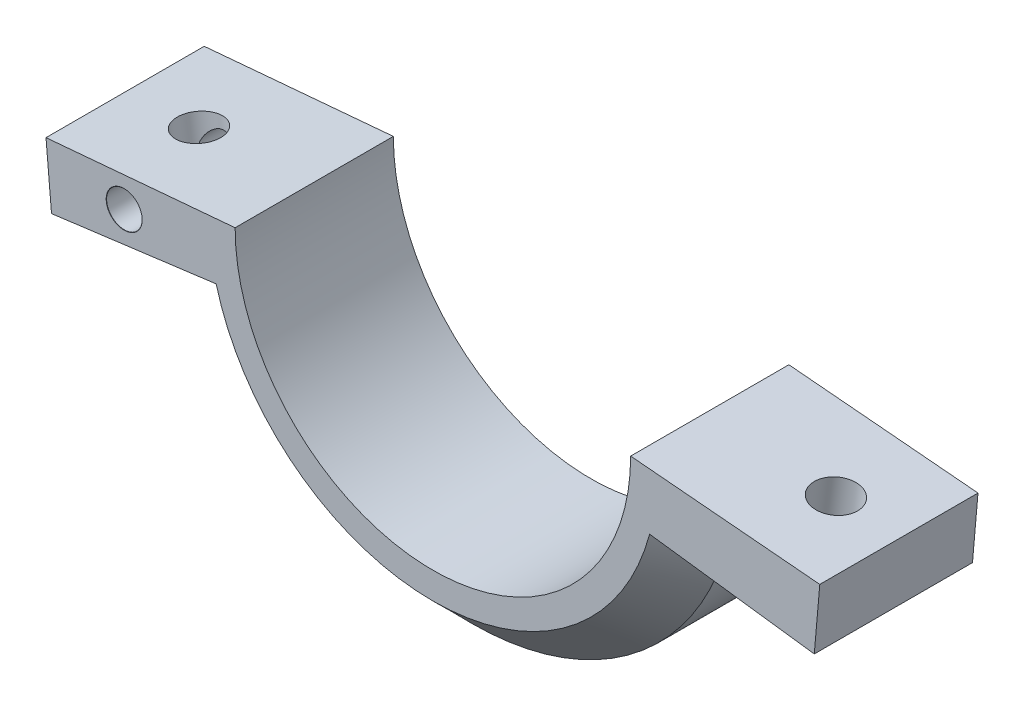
ISO-10303-21;
HEADER;
FILE_DESCRIPTION(('STEP AP214'),'2;1');
FILE_NAME('part.step','',(''),(''),'','','');
FILE_SCHEMA(('AUTOMOTIVE_DESIGN { 1 0 10303 214 1 1 1 1 }'));
ENDSEC;
DATA;
#1=APPLICATION_CONTEXT('core data for automotive mechanical design processes');
#2=APPLICATION_PROTOCOL_DEFINITION('international standard','automotive_design',2000,#1);
#3=PRODUCT_CONTEXT('',#1,'mechanical');
#4=PRODUCT('Part','Part','',(#3));
#5=PRODUCT_RELATED_PRODUCT_CATEGORY('part','',(#4));
#6=PRODUCT_DEFINITION_FORMATION('','',#4);
#7=PRODUCT_DEFINITION_CONTEXT('part definition',#1,'design');
#8=PRODUCT_DEFINITION('design','',#6,#7);
#9=PRODUCT_DEFINITION_SHAPE('','',#8);
#10=(LENGTH_UNIT() NAMED_UNIT(*) SI_UNIT(.MILLI.,.METRE.));
#11=(NAMED_UNIT(*) PLANE_ANGLE_UNIT() SI_UNIT($,.RADIAN.));
#12=(NAMED_UNIT(*) SI_UNIT($,.STERADIAN.) SOLID_ANGLE_UNIT());
#13=UNCERTAINTY_MEASURE_WITH_UNIT(LENGTH_MEASURE(1.E-05),#10,'distance_accuracy_value','');
#14=(GEOMETRIC_REPRESENTATION_CONTEXT(3) GLOBAL_UNCERTAINTY_ASSIGNED_CONTEXT((#13)) GLOBAL_UNIT_ASSIGNED_CONTEXT((#10,
#11,#12)) REPRESENTATION_CONTEXT('',''));
#15=CARTESIAN_POINT('',(0.,0.,0.));
#16=DIRECTION('',(0.,0.,1.));
#17=DIRECTION('',(1.,0.,0.));
#18=AXIS2_PLACEMENT_3D('',#15,#16,#17);
#19=CARTESIAN_POINT('',(-32.3934655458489,51.2410673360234,-20.));
#20=DIRECTION('',(-0.129221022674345,0.991615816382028,0.));
#21=DIRECTION('',(-0.991615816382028,-0.129221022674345,0.));
#22=AXIS2_PLACEMENT_3D('',#19,#20,#21);
#23=PLANE('',#22);
#24=DIRECTION('',(-0.991615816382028,-0.129221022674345,0.));
#25=VECTOR('',#24,1.);
#26=CARTESIAN_POINT('',(-32.3934655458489,51.2410673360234,0.));
#27=LINE('',#26,#25);
#28=CARTESIAN_POINT('',(-27.3981953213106,51.8920189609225,0.));
#29=VERTEX_POINT('',#28);
#30=CARTESIAN_POINT('',(-48.2114268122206,49.1797719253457,0.));
#31=VERTEX_POINT('',#30);
#32=EDGE_CURVE('E154',#29,#31,#27,.T.);
#33=ORIENTED_EDGE('',*,*,#32,.T.);
#34=DIRECTION('',(0.,0.,1.));
#35=VECTOR('',#34,1.);
#36=CARTESIAN_POINT('',(-48.2114268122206,49.1797719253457,-20.));
#37=LINE('',#36,#35);
#38=CARTESIAN_POINT('',(-48.2114268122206,49.1797719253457,-20.));
#39=VERTEX_POINT('',#38);
#40=EDGE_CURVE('E137',#39,#31,#37,.T.);
#41=ORIENTED_EDGE('',*,*,#40,.F.);
#42=DIRECTION('',(-0.991615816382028,-0.129221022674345,0.));
#43=VECTOR('',#42,1.);
#44=CARTESIAN_POINT('',(-32.3934655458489,51.2410673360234,-20.));
#45=LINE('',#44,#43);
#46=CARTESIAN_POINT('',(-27.3981953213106,51.8920189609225,-20.));
#47=VERTEX_POINT('',#46);
#48=EDGE_CURVE('E79',#47,#39,#45,.T.);
#49=ORIENTED_EDGE('',*,*,#48,.F.);
#50=CARTESIAN_POINT('',(-27.3981953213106,51.8920189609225,-20.));
#51=CARTESIAN_POINT('',(-27.8147416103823,51.8377373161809,-19.5836115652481));
#52=CARTESIAN_POINT('',(-28.2312082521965,51.7834660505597,-19.1671421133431));
#53=CARTESIAN_POINT('',(-29.0639994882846,51.6749420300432,-18.3340588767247));
#54=CARTESIAN_POINT('',(-29.4803240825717,51.6206892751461,-17.9174450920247));
#55=CARTESIAN_POINT('',(-30.3128485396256,51.5122000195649,-17.0840908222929));
#56=CARTESIAN_POINT('',(-30.7290484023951,51.4579635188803,-16.6673503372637));
#57=CARTESIAN_POINT('',(-31.5613369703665,51.3495050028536,-15.8337564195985));
#58=CARTESIAN_POINT('',(-31.977425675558,51.2952829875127,-15.4169029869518));
#59=CARTESIAN_POINT('',(-32.3934655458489,51.2410673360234,-15.));
#60=B_SPLINE_CURVE_WITH_KNOTS('',3,(#50,#51,#52,#53,#54,#55,#56,#57,#58,#59),.UNSPECIFIED.,.F.,
.F.,(4,2,2,2,4),(0.,1.77440965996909,3.54881915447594,5.32322861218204,7.09763823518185),.UNSPECIFIED.);
#61=CARTESIAN_POINT('',(-32.3934655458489,51.2410673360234,-15.));
#62=VERTEX_POINT('',#61);
#63=EDGE_CURVE('E11',#47,#62,#60,.T.);
#64=ORIENTED_EDGE('',*,*,#63,.T.);
#65=DIRECTION('',(0.,0.,1.));
#66=VECTOR('',#65,1.);
#67=CARTESIAN_POINT('',(-32.3934655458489,51.2410673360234,-20.));
#68=LINE('',#67,#66);
#69=CARTESIAN_POINT('',(-32.3934655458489,51.2410673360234,-5.00000000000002));
#70=VERTEX_POINT('',#69);
#71=EDGE_CURVE('E266',#62,#70,#68,.T.);
#72=ORIENTED_EDGE('',*,*,#71,.T.);
#73=CARTESIAN_POINT('',(-32.3934655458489,51.2410673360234,-5.00000000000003));
#74=CARTESIAN_POINT('',(-31.977425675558,51.2952829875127,-4.58309701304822));
#75=CARTESIAN_POINT('',(-31.5613369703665,51.3495050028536,-4.16624358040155));
#76=CARTESIAN_POINT('',(-30.7290484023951,51.4579635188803,-3.33264966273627));
#77=CARTESIAN_POINT('',(-30.3128485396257,51.5122000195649,-2.91590917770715));
#78=CARTESIAN_POINT('',(-29.4803240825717,51.6206892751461,-2.08255490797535));
#79=CARTESIAN_POINT('',(-29.0639994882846,51.6749420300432,-1.6659411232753));
#80=CARTESIAN_POINT('',(-28.2312082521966,51.7834660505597,-0.83285788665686));
#81=CARTESIAN_POINT('',(-27.8147416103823,51.8377373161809,-0.416388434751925));
#82=CARTESIAN_POINT('',(-27.3981953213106,51.8920189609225,0.));
#83=B_SPLINE_CURVE_WITH_KNOTS('',3,(#73,#74,#75,#76,#77,#78,#79,#80,#81,#82),.UNSPECIFIED.,.F.,
.F.,(4,2,2,2,4),(0.,1.77440962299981,3.54881908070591,5.32322857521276,7.09763823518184),.UNSPECIFIED.);
#84=EDGE_CURVE('E183',#70,#29,#83,.T.);
#85=ORIENTED_EDGE('',*,*,#84,.T.);
#86=EDGE_LOOP('',(#33,#41,#49,#64,#72,#85));
#87=FACE_BOUND('',#86,.T.);
#88=CARTESIAN_POINT('',(-38.5657501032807,50.4367347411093,-9.979379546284));
#89=DIRECTION('',(0.129221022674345,-0.991615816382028,0.));
#90=DIRECTION('',(0.991615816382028,0.129221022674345,0.));
#91=AXIS2_PLACEMENT_3D('',#88,#89,#90);
#92=CIRCLE('',#91,2.775);
#93=CARTESIAN_POINT('',(-35.8140162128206,50.7953230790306,-9.979379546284));
#94=VERTEX_POINT('',#93);
#95=EDGE_CURVE('E318',#94,#94,#92,.T.);
#96=ORIENTED_EDGE('',*,*,#95,.F.);
#97=EDGE_LOOP('',(#96));
#98=FACE_BOUND('',#97,.T.);
#99=ADVANCED_FACE('F47',(#87,#98),#23,.F.);
#100=CARTESIAN_POINT('',(-48.2114268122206,49.1797719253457,-20.));
#101=DIRECTION('',(0.996194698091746,0.0871557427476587,0.));
#102=DIRECTION('',(-0.0871557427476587,0.996194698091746,0.));
#103=AXIS2_PLACEMENT_3D('',#100,#101,#102);
#104=PLANE('',#103);
#105=DIRECTION('',(-0.0871557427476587,0.996194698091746,0.));
#106=VECTOR('',#105,1.);
#107=CARTESIAN_POINT('',(-48.2114268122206,49.1797719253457,0.));
#108=LINE('',#107,#106);
#109=CARTESIAN_POINT('',(-48.9086727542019,57.1493295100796,0.));
#110=VERTEX_POINT('',#109);
#111=EDGE_CURVE('E290',#31,#110,#108,.T.);
#112=ORIENTED_EDGE('',*,*,#111,.T.);
#113=DIRECTION('',(0.,0.,1.));
#114=VECTOR('',#113,1.);
#115=CARTESIAN_POINT('',(-48.9086727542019,57.1493295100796,-20.));
#116=LINE('',#115,#114);
#117=CARTESIAN_POINT('',(-48.9086727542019,57.1493295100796,-20.));
#118=VERTEX_POINT('',#117);
#119=EDGE_CURVE('E140',#118,#110,#116,.T.);
#120=ORIENTED_EDGE('',*,*,#119,.F.);
#121=DIRECTION('',(-0.0871557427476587,0.996194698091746,0.));
#122=VECTOR('',#121,1.);
#123=CARTESIAN_POINT('',(-48.2114268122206,49.1797719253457,-20.));
#124=LINE('',#123,#122);
#125=EDGE_CURVE('E135',#39,#118,#124,.T.);
#126=ORIENTED_EDGE('',*,*,#125,.F.);
#127=ORIENTED_EDGE('',*,*,#40,.T.);
#128=EDGE_LOOP('',(#112,#120,#126,#127));
#129=FACE_BOUND('',#128,.T.);
#130=ADVANCED_FACE('F136',(#129),#104,.F.);
#131=CARTESIAN_POINT('',(-48.9086727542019,57.1493295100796,-20.));
#132=DIRECTION('',(0.0871557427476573,-0.996194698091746,0.));
#133=DIRECTION('',(0.996194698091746,0.0871557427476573,0.));
#134=AXIS2_PLACEMENT_3D('',#131,#132,#133);
#135=PLANE('',#134);
#136=CARTESIAN_POINT('',(-39.5472220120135,57.9683503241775,-9.979379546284));
#137=DIRECTION('',(0.0871557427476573,-0.996194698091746,0.));
#138=DIRECTION('',(0.996194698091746,0.0871557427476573,0.));
#139=AXIS2_PLACEMENT_3D('',#136,#137,#138);
#140=ELLIPSE('',#139,2.75246408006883,2.75);
#141=CARTESIAN_POINT('',(-36.805231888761,58.2082433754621,-9.979379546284));
#142=VERTEX_POINT('',#141);
#143=EDGE_CURVE('E297',#142,#142,#140,.T.);
#144=ORIENTED_EDGE('',*,*,#143,.T.);
#145=EDGE_LOOP('',(#144));
#146=FACE_BOUND('',#145,.T.);
#147=DIRECTION('',(0.996194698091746,0.0871557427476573,0.));
#148=VECTOR('',#147,1.);
#149=CARTESIAN_POINT('',(-48.9086727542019,57.1493295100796,0.));
#150=LINE('',#149,#148);
#151=CARTESIAN_POINT('',(-25.,59.2410673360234,0.));
#152=VERTEX_POINT('',#151);
#153=EDGE_CURVE('E287',#110,#152,#150,.T.);
#154=ORIENTED_EDGE('',*,*,#153,.T.);
#155=DIRECTION('',(0.,0.,1.));
#156=VECTOR('',#155,1.);
#157=CARTESIAN_POINT('',(-25.,59.2410673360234,-20.));
#158=LINE('',#157,#156);
#159=CARTESIAN_POINT('',(-25.,59.2410673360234,-20.));
#160=VERTEX_POINT('',#159);
#161=EDGE_CURVE('E163',#160,#152,#158,.T.);
#162=ORIENTED_EDGE('',*,*,#161,.F.);
#163=DIRECTION('',(0.996194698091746,0.0871557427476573,0.));
#164=VECTOR('',#163,1.);
#165=CARTESIAN_POINT('',(-48.9086727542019,57.1493295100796,-20.));
#166=LINE('',#165,#164);
#167=EDGE_CURVE('E143',#118,#160,#166,.T.);
#168=ORIENTED_EDGE('',*,*,#167,.F.);
#169=ORIENTED_EDGE('',*,*,#119,.T.);
#170=EDGE_LOOP('',(#154,#162,#168,#169));
#171=FACE_BOUND('',#170,.T.);
#172=ADVANCED_FACE('F223',(#146,#171),#135,.F.);
#173=CARTESIAN_POINT('',(0.,59.2410673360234,-20.));
#174=DIRECTION('',(0.,0.,1.));
#175=DIRECTION('',(1.,0.,0.));
#176=AXIS2_PLACEMENT_3D('',#173,#174,#175);
#177=CYLINDRICAL_SURFACE('',#176,25.);
#178=CARTESIAN_POINT('',(0.,59.2410673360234,0.));
#179=DIRECTION('',(0.,0.,1.));
#180=DIRECTION('',(1.,0.,0.));
#181=AXIS2_PLACEMENT_3D('',#178,#179,#180);
#182=CIRCLE('',#181,25.);
#183=CARTESIAN_POINT('',(25.,59.2410673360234,0.));
#184=VERTEX_POINT('',#183);
#185=EDGE_CURVE('E255',#152,#184,#182,.T.);
#186=ORIENTED_EDGE('',*,*,#185,.T.);
#187=DIRECTION('',(0.,0.,1.));
#188=VECTOR('',#187,1.);
#189=CARTESIAN_POINT('',(25.,59.2410673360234,-20.));
#190=LINE('',#189,#188);
#191=CARTESIAN_POINT('',(25.,59.2410673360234,-20.));
#192=VERTEX_POINT('',#191);
#193=EDGE_CURVE('E249',#192,#184,#190,.T.);
#194=ORIENTED_EDGE('',*,*,#193,.F.);
#195=CARTESIAN_POINT('',(0.,59.2410673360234,-20.));
#196=DIRECTION('',(0.,0.,1.));
#197=DIRECTION('',(1.,0.,0.));
#198=AXIS2_PLACEMENT_3D('',#195,#196,#197);
#199=CIRCLE('',#198,25.);
#200=EDGE_CURVE('E284',#160,#192,#199,.T.);
#201=ORIENTED_EDGE('',*,*,#200,.F.);
#202=ORIENTED_EDGE('',*,*,#161,.T.);
#203=EDGE_LOOP('',(#186,#194,#201,#202));
#204=FACE_BOUND('',#203,.T.);
#205=ADVANCED_FACE('F226',(#204),#177,.F.);
#206=CARTESIAN_POINT('',(48.9086727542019,57.1493295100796,-20.));
#207=DIRECTION('',(0.0871557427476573,0.996194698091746,0.));
#208=DIRECTION('',(-0.996194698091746,0.0871557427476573,0.));
#209=AXIS2_PLACEMENT_3D('',#206,#207,#208);
#210=PLANE('',#209);
#211=CARTESIAN_POINT('',(40.966269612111,57.8441997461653,-9.98303676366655));
#212=DIRECTION('',(0.0871557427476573,0.996194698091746,0.));
#213=DIRECTION('',(-0.996194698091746,0.0871557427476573,0.));
#214=AXIS2_PLACEMENT_3D('',#211,#212,#213);
#215=ELLIPSE('',#214,2.75246408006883,2.75);
#216=CARTESIAN_POINT('',(38.2242794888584,58.0840927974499,-9.98303676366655));
#217=VERTEX_POINT('',#216);
#218=EDGE_CURVE('E240',#217,#217,#215,.T.);
#219=ORIENTED_EDGE('',*,*,#218,.F.);
#220=EDGE_LOOP('',(#219));
#221=FACE_BOUND('',#220,.T.);
#222=DIRECTION('',(-0.996194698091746,0.0871557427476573,0.));
#223=VECTOR('',#222,1.);
#224=CARTESIAN_POINT('',(48.9086727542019,57.1493295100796,0.));
#225=LINE('',#224,#223);
#226=CARTESIAN_POINT('',(48.9086727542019,57.1493295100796,0.));
#227=VERTEX_POINT('',#226);
#228=EDGE_CURVE('E243',#227,#184,#225,.T.);
#229=ORIENTED_EDGE('',*,*,#228,.F.);
#230=DIRECTION('',(0.,0.,1.));
#231=VECTOR('',#230,1.);
#232=CARTESIAN_POINT('',(48.9086727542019,57.1493295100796,-20.));
#233=LINE('',#232,#231);
#234=CARTESIAN_POINT('',(48.9086727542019,57.1493295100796,-20.));
#235=VERTEX_POINT('',#234);
#236=EDGE_CURVE('E246',#235,#227,#233,.T.);
#237=ORIENTED_EDGE('',*,*,#236,.F.);
#238=DIRECTION('',(-0.996194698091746,0.0871557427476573,0.));
#239=VECTOR('',#238,1.);
#240=CARTESIAN_POINT('',(48.9086727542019,57.1493295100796,-20.));
#241=LINE('',#240,#239);
#242=EDGE_CURVE('E304',#235,#192,#241,.T.);
#243=ORIENTED_EDGE('',*,*,#242,.T.);
#244=ORIENTED_EDGE('',*,*,#193,.T.);
#245=EDGE_LOOP('',(#229,#237,#243,#244));
#246=FACE_BOUND('',#245,.T.);
#247=ADVANCED_FACE('F229',(#221,#246),#210,.T.);
#248=CARTESIAN_POINT('',(48.2114268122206,49.1797719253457,-20.));
#249=DIRECTION('',(0.996194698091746,-0.0871557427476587,0.));
#250=DIRECTION('',(0.0871557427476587,0.996194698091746,0.));
#251=AXIS2_PLACEMENT_3D('',#248,#249,#250);
#252=PLANE('',#251);
#253=DIRECTION('',(0.0871557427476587,0.996194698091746,0.));
#254=VECTOR('',#253,1.);
#255=CARTESIAN_POINT('',(48.2114268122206,49.1797719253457,0.));
#256=LINE('',#255,#254);
#257=CARTESIAN_POINT('',(48.2114268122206,49.1797719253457,0.));
#258=VERTEX_POINT('',#257);
#259=EDGE_CURVE('E254',#258,#227,#256,.T.);
#260=ORIENTED_EDGE('',*,*,#259,.F.);
#261=DIRECTION('',(0.,0.,1.));
#262=VECTOR('',#261,1.);
#263=CARTESIAN_POINT('',(48.2114268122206,49.1797719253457,-20.));
#264=LINE('',#263,#262);
#265=CARTESIAN_POINT('',(48.2114268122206,49.1797719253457,-20.));
#266=VERTEX_POINT('',#265);
#267=EDGE_CURVE('E274',#266,#258,#264,.T.);
#268=ORIENTED_EDGE('',*,*,#267,.F.);
#269=DIRECTION('',(0.0871557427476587,0.996194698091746,0.));
#270=VECTOR('',#269,1.);
#271=CARTESIAN_POINT('',(48.2114268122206,49.1797719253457,-20.));
#272=LINE('',#271,#270);
#273=EDGE_CURVE('E300',#266,#235,#272,.T.);
#274=ORIENTED_EDGE('',*,*,#273,.T.);
#275=ORIENTED_EDGE('',*,*,#236,.T.);
#276=EDGE_LOOP('',(#260,#268,#274,#275));
#277=FACE_BOUND('',#276,.T.);
#278=ADVANCED_FACE('F199',(#277),#252,.T.);
#279=CARTESIAN_POINT('',(32.3934655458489,51.2410673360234,-20.));
#280=DIRECTION('',(-0.129221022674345,-0.991615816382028,0.));
#281=DIRECTION('',(0.991615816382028,-0.129221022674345,0.));
#282=AXIS2_PLACEMENT_3D('',#279,#280,#281);
#283=PLANE('',#282);
#284=CARTESIAN_POINT('',(39.9770107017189,50.252828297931,-9.98303676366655));
#285=DIRECTION('',(-0.129221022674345,-0.991615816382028,0.));
#286=DIRECTION('',(0.991615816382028,-0.129221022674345,0.));
#287=AXIS2_PLACEMENT_3D('',#284,#285,#286);
#288=CIRCLE('',#287,2.775);
#289=CARTESIAN_POINT('',(42.728744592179,49.8942399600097,-9.98303676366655));
#290=VERTEX_POINT('',#289);
#291=EDGE_CURVE('E328',#290,#290,#288,.T.);
#292=ORIENTED_EDGE('',*,*,#291,.F.);
#293=EDGE_LOOP('',(#292));
#294=FACE_BOUND('',#293,.T.);
#295=DIRECTION('',(0.991615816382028,-0.129221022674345,0.));
#296=VECTOR('',#295,1.);
#297=CARTESIAN_POINT('',(32.3934655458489,51.2410673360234,0.));
#298=LINE('',#297,#296);
#299=CARTESIAN_POINT('',(27.3981953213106,51.8920189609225,0.));
#300=VERTEX_POINT('',#299);
#301=EDGE_CURVE('E150',#300,#258,#298,.T.);
#302=ORIENTED_EDGE('',*,*,#301,.F.);
#303=CARTESIAN_POINT('',(27.3981953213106,51.8920189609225,0.));
#304=CARTESIAN_POINT('',(27.8147416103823,51.8377373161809,-0.416388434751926));
#305=CARTESIAN_POINT('',(28.2312082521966,51.7834660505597,-0.832857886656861));
#306=CARTESIAN_POINT('',(29.0639994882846,51.6749420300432,-1.6659411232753));
#307=CARTESIAN_POINT('',(29.4803240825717,51.6206892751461,-2.08255490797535));
#308=CARTESIAN_POINT('',(30.3128485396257,51.5122000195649,-2.91590917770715));
#309=CARTESIAN_POINT('',(30.7290484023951,51.4579635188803,-3.33264966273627));
#310=CARTESIAN_POINT('',(31.5613369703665,51.3495050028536,-4.16624358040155));
#311=CARTESIAN_POINT('',(31.977425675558,51.2952829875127,-4.58309701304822));
#312=CARTESIAN_POINT('',(32.3934655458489,51.2410673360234,-5.00000000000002));
#313=B_SPLINE_CURVE_WITH_KNOTS('',3,(#303,#304,#305,#306,#307,#308,#309,#310,#311,#312),
.UNSPECIFIED.,.F.,.F.,(4,2,2,2,4),(0.,1.77440965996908,3.54881915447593,5.32322861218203,
7.09763823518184),.UNSPECIFIED.);
#314=CARTESIAN_POINT('',(32.3934655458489,51.2410673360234,-5.00000000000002));
#315=VERTEX_POINT('',#314);
#316=EDGE_CURVE('E175',#300,#315,#313,.T.);
#317=ORIENTED_EDGE('',*,*,#316,.T.);
#318=DIRECTION('',(0.,0.,1.));
#319=VECTOR('',#318,1.);
#320=CARTESIAN_POINT('',(32.3934655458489,51.2410673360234,-20.));
#321=LINE('',#320,#319);
#322=CARTESIAN_POINT('',(32.3934655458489,51.2410673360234,-15.));
#323=VERTEX_POINT('',#322);
#324=EDGE_CURVE('E270',#323,#315,#321,.T.);
#325=ORIENTED_EDGE('',*,*,#324,.F.);
#326=CARTESIAN_POINT('',(32.3934655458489,51.2410673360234,-15.));
#327=CARTESIAN_POINT('',(31.977425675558,51.2952829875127,-15.4169029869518));
#328=CARTESIAN_POINT('',(31.5613369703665,51.3495050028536,-15.8337564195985));
#329=CARTESIAN_POINT('',(30.7290484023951,51.4579635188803,-16.6673503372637));
#330=CARTESIAN_POINT('',(30.3128485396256,51.5122000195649,-17.0840908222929));
#331=CARTESIAN_POINT('',(29.4803240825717,51.6206892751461,-17.9174450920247));
#332=CARTESIAN_POINT('',(29.0639994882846,51.6749420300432,-18.3340588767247));
#333=CARTESIAN_POINT('',(28.2312082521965,51.7834660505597,-19.1671421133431));
#334=CARTESIAN_POINT('',(27.8147416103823,51.8377373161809,-19.5836115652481));
#335=CARTESIAN_POINT('',(27.3981953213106,51.8920189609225,-20.));
#336=B_SPLINE_CURVE_WITH_KNOTS('',3,(#326,#327,#328,#329,#330,#331,#332,#333,#334,#335),
.UNSPECIFIED.,.F.,.F.,(4,2,2,2,4),(0.,1.77440962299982,3.54881908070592,5.32322857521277,
7.09763823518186),.UNSPECIFIED.);
#337=CARTESIAN_POINT('',(27.3981953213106,51.8920189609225,-20.));
#338=VERTEX_POINT('',#337);
#339=EDGE_CURVE('E64',#323,#338,#336,.T.);
#340=ORIENTED_EDGE('',*,*,#339,.T.);
#341=DIRECTION('',(0.991615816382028,-0.129221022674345,0.));
#342=VECTOR('',#341,1.);
#343=CARTESIAN_POINT('',(32.3934655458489,51.2410673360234,-20.));
#344=LINE('',#343,#342);
#345=EDGE_CURVE('E72',#338,#266,#344,.T.);
#346=ORIENTED_EDGE('',*,*,#345,.T.);
#347=ORIENTED_EDGE('',*,*,#267,.T.);
#348=EDGE_LOOP('',(#302,#317,#325,#340,#346,#347));
#349=FACE_BOUND('',#348,.T.);
#350=ADVANCED_FACE('F193',(#294,#349),#283,.T.);
#351=CARTESIAN_POINT('',(0.,59.2410673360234,-20.));
#352=DIRECTION('',(0.,0.,1.));
#353=DIRECTION('',(1.,0.,0.));
#354=AXIS2_PLACEMENT_3D('',#351,#352,#353);
#355=CYLINDRICAL_SURFACE('',#354,33.3666991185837);
#356=ORIENTED_EDGE('',*,*,#324,.T.);
#357=CARTESIAN_POINT('',(0.,59.2410673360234,-5.00000000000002));
#358=DIRECTION('',(0.,0.,1.));
#359=DIRECTION('',(1.,0.,0.));
#360=AXIS2_PLACEMENT_3D('',#357,#358,#359);
#361=CIRCLE('',#360,33.3666991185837);
#362=EDGE_CURVE('E170',#315,#70,#361,.F.);
#363=ORIENTED_EDGE('',*,*,#362,.T.);
#364=ORIENTED_EDGE('',*,*,#71,.F.);
#365=CARTESIAN_POINT('',(0.,59.2410673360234,-15.));
#366=DIRECTION('',(0.,0.,1.));
#367=DIRECTION('',(1.,0.,0.));
#368=AXIS2_PLACEMENT_3D('',#365,#366,#367);
#369=CIRCLE('',#368,33.3666991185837);
#370=EDGE_CURVE('E161',#62,#323,#369,.T.);
#371=ORIENTED_EDGE('',*,*,#370,.T.);
#372=EDGE_LOOP('',(#356,#363,#364,#371));
#373=FACE_BOUND('',#372,.T.);
#374=ADVANCED_FACE('F198',(#373),#355,.T.);
#375=CARTESIAN_POINT('',(0.,59.2410673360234,-20.));
#376=DIRECTION('',(0.,0.,1.));
#377=DIRECTION('',(1.,0.,0.));
#378=AXIS2_PLACEMENT_3D('',#375,#376,#377);
#379=PLANE('',#378);
#380=CARTESIAN_POINT('',(-39.0239816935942,54.2337762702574,-20.));
#381=DIRECTION('',(0.,0.,1.));
#382=DIRECTION('',(1.,0.,0.));
#383=AXIS2_PLACEMENT_3D('',#380,#381,#382);
#384=CIRCLE('',#383,2.24999999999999);
#385=CARTESIAN_POINT('',(-36.7739816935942,54.2337762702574,-20.));
#386=VERTEX_POINT('',#385);
#387=EDGE_CURVE('E332',#386,#386,#384,.T.);
#388=ORIENTED_EDGE('',*,*,#387,.T.);
#389=EDGE_LOOP('',(#388));
#390=FACE_BOUND('',#389,.T.);
#391=ORIENTED_EDGE('',*,*,#345,.F.);
#392=CARTESIAN_POINT('',(0.,59.2410673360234,-20.));
#393=DIRECTION('',(0.,0.,1.));
#394=DIRECTION('',(1.,0.,0.));
#395=AXIS2_PLACEMENT_3D('',#392,#393,#394);
#396=CIRCLE('',#395,28.3666991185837);
#397=EDGE_CURVE('E147',#338,#47,#396,.F.);
#398=ORIENTED_EDGE('',*,*,#397,.T.);
#399=ORIENTED_EDGE('',*,*,#48,.T.);
#400=ORIENTED_EDGE('',*,*,#125,.T.);
#401=ORIENTED_EDGE('',*,*,#167,.T.);
#402=ORIENTED_EDGE('',*,*,#200,.T.);
#403=ORIENTED_EDGE('',*,*,#242,.F.);
#404=ORIENTED_EDGE('',*,*,#273,.F.);
#405=EDGE_LOOP('',(#391,#398,#399,#400,#401,#402,#403,#404));
#406=FACE_BOUND('',#405,.T.);
#407=ADVANCED_FACE('F145',(#390,#406),#379,.F.);
#408=CARTESIAN_POINT('',(0.,59.2410673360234,0.));
#409=DIRECTION('',(0.,0.,1.));
#410=DIRECTION('',(1.,0.,0.));
#411=AXIS2_PLACEMENT_3D('',#408,#409,#410);
#412=PLANE('',#411);
#413=CARTESIAN_POINT('',(-39.0239816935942,54.2337762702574,0.));
#414=DIRECTION('',(0.,0.,1.));
#415=DIRECTION('',(1.,0.,0.));
#416=AXIS2_PLACEMENT_3D('',#413,#414,#415);
#417=CIRCLE('',#416,2.275);
#418=CARTESIAN_POINT('',(-36.7489816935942,54.2337762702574,0.));
#419=VERTEX_POINT('',#418);
#420=EDGE_CURVE('E340',#419,#419,#417,.T.);
#421=ORIENTED_EDGE('',*,*,#420,.F.);
#422=EDGE_LOOP('',(#421));
#423=FACE_BOUND('',#422,.T.);
#424=CARTESIAN_POINT('',(0.,59.2410673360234,0.));
#425=DIRECTION('',(0.,0.,1.));
#426=DIRECTION('',(1.,0.,0.));
#427=AXIS2_PLACEMENT_3D('',#424,#425,#426);
#428=CIRCLE('',#427,28.3666991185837);
#429=EDGE_CURVE('E156',#29,#300,#428,.T.);
#430=ORIENTED_EDGE('',*,*,#429,.T.);
#431=ORIENTED_EDGE('',*,*,#301,.T.);
#432=ORIENTED_EDGE('',*,*,#259,.T.);
#433=ORIENTED_EDGE('',*,*,#228,.T.);
#434=ORIENTED_EDGE('',*,*,#185,.F.);
#435=ORIENTED_EDGE('',*,*,#153,.F.);
#436=ORIENTED_EDGE('',*,*,#111,.F.);
#437=ORIENTED_EDGE('',*,*,#32,.F.);
#438=EDGE_LOOP('',(#430,#431,#432,#433,#434,#435,#436,#437));
#439=FACE_BOUND('',#438,.T.);
#440=ADVANCED_FACE('F259',(#423,#439),#412,.T.);
#441=CARTESIAN_POINT('',(0.,59.2410673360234,0.));
#442=DIRECTION('',(0.,0.,-1.));
#443=DIRECTION('',(-1.,0.,0.));
#444=AXIS2_PLACEMENT_3D('',#441,#442,#443);
#445=CONICAL_SURFACE('',#444,28.3666991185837,0.785398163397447);
#446=ORIENTED_EDGE('',*,*,#84,.F.);
#447=ORIENTED_EDGE('',*,*,#362,.F.);
#448=ORIENTED_EDGE('',*,*,#316,.F.);
#449=ORIENTED_EDGE('',*,*,#429,.F.);
#450=EDGE_LOOP('',(#446,#447,#448,#449));
#451=FACE_BOUND('',#450,.T.);
#452=ADVANCED_FACE('F191',(#451),#445,.T.);
#453=CARTESIAN_POINT('',(0.,59.2410673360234,-15.));
#454=DIRECTION('',(0.,0.,1.));
#455=DIRECTION('',(1.,0.,0.));
#456=AXIS2_PLACEMENT_3D('',#453,#454,#455);
#457=CONICAL_SURFACE('',#456,33.3666991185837,0.785398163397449);
#458=ORIENTED_EDGE('',*,*,#63,.F.);
#459=ORIENTED_EDGE('',*,*,#397,.F.);
#460=ORIENTED_EDGE('',*,*,#339,.F.);
#461=ORIENTED_EDGE('',*,*,#370,.F.);
#462=EDGE_LOOP('',(#458,#459,#460,#461));
#463=FACE_BOUND('',#462,.T.);
#464=ADVANCED_FACE('F50',(#463),#457,.T.);
#465=CARTESIAN_POINT('',(-38.5657501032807,50.4367347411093,-9.979379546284));
#466=DIRECTION('',(0.129221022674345,-0.991615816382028,0.));
#467=DIRECTION('',(0.991615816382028,0.129221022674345,0.));
#468=AXIS2_PLACEMENT_3D('',#465,#466,#467);
#469=CYLINDRICAL_SURFACE('',#468,2.75);
#470=CARTESIAN_POINT('',(-36.7739816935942,54.2337762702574,-11.5354584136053));
#471=CARTESIAN_POINT('',(-36.7739845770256,54.11523911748,-11.5577745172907));
#472=CARTESIAN_POINT('',(-36.7834181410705,53.9990743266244,-11.5926202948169));
#473=CARTESIAN_POINT('',(-36.8095780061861,53.8310324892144,-11.655843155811));
#474=CARTESIAN_POINT('',(-36.8203712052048,53.7758321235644,-11.6788643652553));
#475=CARTESIAN_POINT('',(-36.8457119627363,53.6674520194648,-11.7275066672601));
#476=CARTESIAN_POINT('',(-36.8602588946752,53.6142719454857,-11.7531273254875));
#477=CARTESIAN_POINT('',(-36.8978252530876,53.4941585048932,-11.8140658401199));
#478=CARTESIAN_POINT('',(-36.922076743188,53.4279154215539,-11.8499775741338));
#479=CARTESIAN_POINT('',(-36.976314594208,53.2986455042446,-11.9232050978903));
#480=CARTESIAN_POINT('',(-37.0063030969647,53.2356198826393,-11.9605214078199));
#481=CARTESIAN_POINT('',(-37.1045594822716,53.0515513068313,-12.072651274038));
#482=CARTESIAN_POINT('',(-37.1812557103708,52.9350843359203,-12.1478816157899));
#483=CARTESIAN_POINT('',(-37.3435240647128,52.7328879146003,-12.2810074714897));
#484=CARTESIAN_POINT('',(-37.4259266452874,52.6451844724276,-12.3397912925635));
#485=CARTESIAN_POINT('',(-37.6068289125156,52.4819306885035,-12.4489621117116));
#486=CARTESIAN_POINT('',(-37.705305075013,52.4063629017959,-12.4993611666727));
#487=CARTESIAN_POINT('',(-37.8967098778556,52.2838971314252,-12.5790638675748));
#488=CARTESIAN_POINT('',(-37.9869774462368,52.2342819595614,-12.610564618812));
#489=CARTESIAN_POINT('',(-38.1759618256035,52.1471129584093,-12.6633938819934));
#490=CARTESIAN_POINT('',(-38.2746730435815,52.1095512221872,-12.6847290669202));
#491=CARTESIAN_POINT('',(-38.4786964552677,52.0482418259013,-12.7156306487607));
#492=CARTESIAN_POINT('',(-38.5840408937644,52.0245685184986,-12.7251340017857));
#493=CARTESIAN_POINT('',(-38.797404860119,51.9926183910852,-12.7313441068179));
#494=CARTESIAN_POINT('',(-38.9054237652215,51.9843380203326,-12.7280538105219));
#495=CARTESIAN_POINT('',(-39.111152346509,51.9833149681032,-12.7099174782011));
#496=CARTESIAN_POINT('',(-39.2089523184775,51.9893017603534,-12.6960857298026));
#497=CARTESIAN_POINT('',(-39.4012156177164,52.013508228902,-12.6591890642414));
#498=CARTESIAN_POINT('',(-39.4956779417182,52.0317315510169,-12.6361213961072));
#499=CARTESIAN_POINT('',(-39.6851542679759,52.0807499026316,-12.5806148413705));
#500=CARTESIAN_POINT('',(-39.7798353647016,52.1122580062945,-12.5476812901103));
#501=CARTESIAN_POINT('',(-39.9620033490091,52.1862675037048,-12.4751936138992));
#502=CARTESIAN_POINT('',(-40.0494898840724,52.2287694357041,-12.4356391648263));
#503=CARTESIAN_POINT('',(-40.2326288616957,52.3325201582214,-12.3439268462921));
#504=CARTESIAN_POINT('',(-40.3266418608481,52.3957998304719,-12.2908054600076));
#505=CARTESIAN_POINT('',(-40.5033428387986,52.5347543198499,-12.181289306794));
#506=CARTESIAN_POINT('',(-40.5859972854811,52.610464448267,-12.1248855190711));
#507=CARTESIAN_POINT('',(-40.7094160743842,52.7416447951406,-12.0346736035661));
#508=CARTESIAN_POINT('',(-40.7539383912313,52.793480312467,-12.0006392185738));
#509=CARTESIAN_POINT('',(-40.8384793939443,52.9015565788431,-11.9338510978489));
#510=CARTESIAN_POINT('',(-40.8784956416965,52.9577996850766,-11.9010980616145));
#511=CARTESIAN_POINT('',(-40.9536373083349,53.0745812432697,-11.8383111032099));
#512=CARTESIAN_POINT('',(-40.9887791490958,53.1351041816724,-11.8082681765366));
#513=CARTESIAN_POINT('',(-41.0538995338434,53.2606738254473,-11.7524774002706));
#514=CARTESIAN_POINT('',(-41.0838844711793,53.3257147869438,-11.7267242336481));
#515=CARTESIAN_POINT('',(-41.1399903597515,53.4649991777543,-11.6799876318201));
#516=CARTESIAN_POINT('',(-41.165700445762,53.5395679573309,-11.6594574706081));
#517=CARTESIAN_POINT('',(-41.2094326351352,53.692831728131,-11.6284832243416));
#518=CARTESIAN_POINT('',(-41.2274746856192,53.7715154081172,-11.618012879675));
#519=CARTESIAN_POINT('',(-41.25507319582,53.9315370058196,-11.6089646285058));
#520=CARTESIAN_POINT('',(-41.2645810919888,54.0128874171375,-11.6104543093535));
#521=CARTESIAN_POINT('',(-41.2746912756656,54.175123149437,-11.6251922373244));
#522=CARTESIAN_POINT('',(-41.2752792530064,54.2560075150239,-11.6384593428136));
#523=CARTESIAN_POINT('',(-41.2670874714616,54.4369812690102,-11.6793965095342));
#524=CARTESIAN_POINT('',(-41.2556956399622,54.5362573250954,-11.7100178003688));
#525=CARTESIAN_POINT('',(-41.2209639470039,54.7291988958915,-11.7808779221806));
#526=CARTESIAN_POINT('',(-41.1975880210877,54.8228465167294,-11.821145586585));
#527=CARTESIAN_POINT('',(-41.147744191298,54.9800977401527,-11.8952764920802));
#528=CARTESIAN_POINT('',(-41.1237554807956,55.045063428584,-11.9279914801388));
#529=CARTESIAN_POINT('',(-41.0702178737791,55.1719465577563,-11.9948218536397));
#530=CARTESIAN_POINT('',(-41.0406666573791,55.2338627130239,-12.0289378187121));
#531=CARTESIAN_POINT('',(-40.9761101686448,55.3546612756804,-12.0975057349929));
#532=CARTESIAN_POINT('',(-40.9411012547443,55.4135416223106,-12.1319578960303));
#533=CARTESIAN_POINT('',(-40.8656951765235,55.5281115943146,-12.2002739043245));
#534=CARTESIAN_POINT('',(-40.8252952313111,55.583799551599,-12.234137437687));
#535=CARTESIAN_POINT('',(-40.6947667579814,55.7472349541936,-12.3345152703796));
#536=CARTESIAN_POINT('',(-40.5961130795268,55.8498334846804,-12.3989171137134));
#537=CARTESIAN_POINT('',(-40.4320564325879,55.9901916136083,-12.4860148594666));
#538=CARTESIAN_POINT('',(-40.374748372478,56.0346881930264,-12.5134435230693));
#539=CARTESIAN_POINT('',(-40.2549308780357,56.1186130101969,-12.564381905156));
#540=CARTESIAN_POINT('',(-40.1924245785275,56.1580442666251,-12.587893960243));
#541=CARTESIAN_POINT('',(-40.0406765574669,56.2434367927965,-12.6373053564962));
#542=CARTESIAN_POINT('',(-39.9495161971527,56.2871303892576,-12.6613456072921));
#543=CARTESIAN_POINT('',(-39.7603183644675,56.362309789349,-12.6991489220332));
#544=CARTESIAN_POINT('',(-39.6622862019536,56.3938048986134,-12.712919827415));
#545=CARTESIAN_POINT('',(-39.4615444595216,56.4432452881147,-12.7290294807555));
#546=CARTESIAN_POINT('',(-39.3588195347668,56.4611421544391,-12.7313275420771));
#547=CARTESIAN_POINT('',(-39.1522933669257,56.4825127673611,-12.7240905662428));
#548=CARTESIAN_POINT('',(-39.0484920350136,56.4859853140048,-12.7145545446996));
#549=CARTESIAN_POINT('',(-38.8483727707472,56.4790327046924,-12.68519326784));
#550=CARTESIAN_POINT('',(-38.7519448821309,56.4693146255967,-12.6659236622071));
#551=CARTESIAN_POINT('',(-38.5632249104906,56.4381718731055,-12.6187245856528));
#552=CARTESIAN_POINT('',(-38.4709339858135,56.4167439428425,-12.5907927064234));
#553=CARTESIAN_POINT('',(-38.2833437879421,56.3608503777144,-12.5248160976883));
#554=CARTESIAN_POINT('',(-38.188617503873,56.3253238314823,-12.4860543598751));
#555=CARTESIAN_POINT('',(-38.0070697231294,56.2433350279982,-12.4022230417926));
#556=CARTESIAN_POINT('',(-37.9202519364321,56.1968676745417,-12.3571505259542));
#557=CARTESIAN_POINT('',(-37.7374989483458,56.0834675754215,-12.2528210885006));
#558=CARTESIAN_POINT('',(-37.6435252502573,56.0142848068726,-12.1925814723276));
#559=CARTESIAN_POINT('',(-37.4680525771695,55.8632002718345,-12.0696420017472));
#560=CARTESIAN_POINT('',(-37.386572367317,55.7812797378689,-12.0069386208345));
#561=CARTESIAN_POINT('',(-37.2400345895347,55.6093447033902,-11.8865267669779));
#562=CARTESIAN_POINT('',(-37.1743754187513,55.5199094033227,-11.8287231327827));
#563=CARTESIAN_POINT('',(-37.0554089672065,55.3291362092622,-11.7204072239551));
#564=CARTESIAN_POINT('',(-37.0020744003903,55.227825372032,-11.6698789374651));
#565=CARTESIAN_POINT('',(-36.9266717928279,55.051881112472,-11.6003877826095));
#566=CARTESIAN_POINT('',(-36.9003001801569,54.9810273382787,-11.5766373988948));
#567=CARTESIAN_POINT('',(-36.8543840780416,54.8347664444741,-11.5386419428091));
#568=CARTESIAN_POINT('',(-36.8348222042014,54.7593715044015,-11.5243725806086));
#569=CARTESIAN_POINT('',(-36.8041873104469,54.6088128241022,-11.5081703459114));
#570=CARTESIAN_POINT('',(-36.7927953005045,54.533769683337,-11.5057494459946));
#571=CARTESIAN_POINT('',(-36.777689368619,54.3834319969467,-11.5123904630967));
#572=CARTESIAN_POINT('',(-36.7739798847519,54.3081373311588,-11.5214590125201));
#573=CARTESIAN_POINT('',(-36.7739816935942,54.2337762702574,-11.5354584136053));
#574=B_SPLINE_CURVE_WITH_KNOTS('',3,(#470,#471,#472,#473,#474,#475,#476,#477,#478,#479,#480,
#481,#482,#483,#484,#485,#486,#487,#488,#489,#490,#491,#492,#493,#494,#495,#496,#497,#498,#499,
#500,#501,#502,#503,#504,#505,#506,#507,#508,#509,#510,#511,#512,#513,#514,#515,#516,#517,#518,
#519,#520,#521,#522,#523,#524,#525,#526,#527,#528,#529,#530,#531,#532,#533,#534,#535,#536,#537,
#538,#539,#540,#541,#542,#543,#544,#545,#546,#547,#548,#549,#550,#551,#552,#553,#554,#555,#556,
#557,#558,#559,#560,#561,#562,#563,#564,#565,#566,#567,#568,#569,#570,#571,#572,#573),
.UNSPECIFIED.,.T.,.F.,(4,2,2,2,2,2,2,2,2,2,2,2,2,2,2,2,2,2,2,2,2,2,2,2,2,2,2,2,2,2,2,2,2,2,2,2,
2,2,2,2,2,2,2,2,2,2,2,2,2,2,2,4),(0.,0.361328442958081,0.543544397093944,0.725729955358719,
0.962871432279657,1.2001016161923,1.67304558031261,2.07339323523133,2.47316013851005,
2.79499339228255,3.11661509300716,3.43994326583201,3.76319684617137,4.05875305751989,
4.35439736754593,4.66847716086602,4.98257233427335,5.35675331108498,5.7320162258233,
5.96080335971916,6.18971369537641,6.41783305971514,6.64566753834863,6.88926504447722,
7.13222493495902,7.37655877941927,7.62128456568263,7.93309476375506,8.24584886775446,
8.47535520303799,8.70495746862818,8.93471359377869,9.16458869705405,9.6300958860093,
9.8624454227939,10.0946558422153,10.4050066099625,10.7151201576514,11.0263326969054,
11.337571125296,11.6327680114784,11.9280470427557,12.2518973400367,12.5758987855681,
12.9685002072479,13.3616856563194,13.7359503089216,14.1093782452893,14.346348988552,
14.5827102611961,14.8092490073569,15.0359185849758),.UNSPECIFIED.);
#575=CARTESIAN_POINT('',(-36.7739816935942,54.2337762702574,-11.5354584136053));
#576=VERTEX_POINT('',#575);
#577=EDGE_CURVE('E53',#576,#576,#574,.T.);
#578=ORIENTED_EDGE('',*,*,#577,.T.);
#579=EDGE_LOOP('',(#578));
#580=FACE_BOUND('',#579,.T.);
#581=CARTESIAN_POINT('',(-36.7739816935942,54.2337762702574,-8.42330067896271));
#582=CARTESIAN_POINT('',(-36.7739856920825,54.3049173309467,-8.43668568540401));
#583=CARTESIAN_POINT('',(-36.7773775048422,54.3769659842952,-8.44558393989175));
#584=CARTESIAN_POINT('',(-36.791207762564,54.5209023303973,-8.45287605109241));
#585=CARTESIAN_POINT('',(-36.801642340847,54.5927900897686,-8.45127566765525));
#586=CARTESIAN_POINT('',(-36.8291197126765,54.7340251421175,-8.43790660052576));
#587=CARTESIAN_POINT('',(-36.8461411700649,54.8033798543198,-8.42617059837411));
#588=CARTESIAN_POINT('',(-36.8860055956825,54.9384281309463,-8.39439456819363));
#589=CARTESIAN_POINT('',(-36.9088577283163,55.0041157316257,-8.37434143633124));
#590=CARTESIAN_POINT('',(-36.976458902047,55.173542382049,-8.31291037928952));
#591=CARTESIAN_POINT('',(-37.0256640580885,55.2735395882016,-8.26621917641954));
#592=CARTESIAN_POINT('',(-37.1358745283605,55.4624270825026,-8.1646800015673));
#593=CARTESIAN_POINT('',(-37.1969238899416,55.551273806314,-8.10980176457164));
#594=CARTESIAN_POINT('',(-37.3075929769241,55.6903186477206,-8.01623931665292));
#595=CARTESIAN_POINT('',(-37.3541703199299,55.7434790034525,-7.97830281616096));
#596=CARTESIAN_POINT('',(-37.4520714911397,55.8451696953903,-7.90234078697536));
#597=CARTESIAN_POINT('',(-37.5033969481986,55.8936984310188,-7.86431523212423));
#598=CARTESIAN_POINT('',(-37.6642872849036,56.0320270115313,-7.75171025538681));
#599=CARTESIAN_POINT('',(-37.7810055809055,56.1148704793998,-7.67838934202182));
#600=CARTESIAN_POINT('',(-38.0024584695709,56.2415443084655,-7.55857191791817));
#601=CARTESIAN_POINT('',(-38.1033870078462,56.2899666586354,-7.50985311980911));
#602=CARTESIAN_POINT('',(-38.3148131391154,56.372090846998,-7.42156201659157));
#603=CARTESIAN_POINT('',(-38.425297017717,56.4058133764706,-7.38197689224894));
#604=CARTESIAN_POINT('',(-38.6363384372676,56.4523508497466,-7.32011714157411));
#605=CARTESIAN_POINT('',(-38.73586001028,56.4675610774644,-7.29612765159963));
#606=CARTESIAN_POINT('',(-38.9380014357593,56.4844142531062,-7.25860460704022));
#607=CARTESIAN_POINT('',(-39.0406196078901,56.4860644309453,-7.2450654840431));
#608=CARTESIAN_POINT('',(-39.246310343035,56.4751386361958,-7.22946726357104));
#609=CARTESIAN_POINT('',(-39.3493833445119,56.4625198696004,-7.22744280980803));
#610=CARTESIAN_POINT('',(-39.5523829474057,56.423292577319,-7.23507035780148));
#611=CARTESIAN_POINT('',(-39.6523092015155,56.3966825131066,-7.2447236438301));
#612=CARTESIAN_POINT('',(-39.8415928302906,56.332240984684,-7.27409851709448));
#613=CARTESIAN_POINT('',(-39.9312252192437,56.2949849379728,-7.29333419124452));
#614=CARTESIAN_POINT('',(-40.1031946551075,56.2103876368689,-7.34020054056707));
#615=CARTESIAN_POINT('',(-40.1855298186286,56.1630437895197,-7.3678333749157));
#616=CARTESIAN_POINT('',(-40.3501848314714,56.0543346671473,-7.43314028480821));
#617=CARTESIAN_POINT('',(-40.4315675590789,55.9920127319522,-7.47157071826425));
#618=CARTESIAN_POINT('',(-40.583517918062,55.8587611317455,-7.5543578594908));
#619=CARTESIAN_POINT('',(-40.6540787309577,55.7878260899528,-7.59871827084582));
#620=CARTESIAN_POINT('',(-40.7980840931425,55.6228324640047,-7.70090819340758));
#621=CARTESIAN_POINT('',(-40.8689554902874,55.5270632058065,-7.75959680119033));
#622=CARTESIAN_POINT('',(-40.9946431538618,55.3260558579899,-7.87820653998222));
#623=CARTESIAN_POINT('',(-41.0494416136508,55.2208074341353,-7.9381289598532));
#624=CARTESIAN_POINT('',(-41.1361975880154,55.0158956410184,-8.04619208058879));
#625=CARTESIAN_POINT('',(-41.1702335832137,54.9173785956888,-8.09483464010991));
#626=CARTESIAN_POINT('',(-41.2248188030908,54.71328073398,-8.18427484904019));
#627=CARTESIAN_POINT('',(-41.2453978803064,54.6077161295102,-8.22508971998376));
#628=CARTESIAN_POINT('',(-41.2674824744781,54.4215557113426,-8.28236141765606));
#629=CARTESIAN_POINT('',(-41.2727809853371,54.3425583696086,-8.30244876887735));
#630=CARTESIAN_POINT('',(-41.2748138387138,54.1825879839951,-8.33235023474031));
#631=CARTESIAN_POINT('',(-41.2715670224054,54.101619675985,-8.34218688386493));
#632=CARTESIAN_POINT('',(-41.2561463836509,53.9395060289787,-8.3498441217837));
#633=CARTESIAN_POINT('',(-41.2439270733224,53.8583618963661,-8.34760311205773));
#634=CARTESIAN_POINT('',(-41.2110203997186,53.6989756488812,-8.33141042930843));
#635=CARTESIAN_POINT('',(-41.1903202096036,53.6207381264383,-8.3174409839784));
#636=CARTESIAN_POINT('',(-41.1345149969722,53.4472076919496,-8.27482009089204));
#637=CARTESIAN_POINT('',(-41.0969794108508,53.3534801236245,-8.24310176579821));
#638=CARTESIAN_POINT('',(-41.0116336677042,53.1747105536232,-8.17013787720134));
#639=CARTESIAN_POINT('',(-40.9637901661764,53.0896980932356,-8.12886136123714));
#640=CARTESIAN_POINT('',(-40.8732640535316,52.9502050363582,-8.05334686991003));
#641=CARTESIAN_POINT('',(-40.832703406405,52.8936988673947,-8.02023792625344));
#642=CARTESIAN_POINT('',(-40.7469652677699,52.7851160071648,-7.95273554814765));
#643=CARTESIAN_POINT('',(-40.7017857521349,52.7330412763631,-7.91834155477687));
#644=CARTESIAN_POINT('',(-40.5595308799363,52.5834637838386,-7.81490699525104));
#645=CARTESIAN_POINT('',(-40.4556460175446,52.4924653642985,-7.74553110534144));
#646=CARTESIAN_POINT('',(-40.2475500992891,52.3418809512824,-7.62303280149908));
#647=CARTESIAN_POINT('',(-40.1457700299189,52.2796249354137,-7.56903989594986));
#648=CARTESIAN_POINT('',(-39.930387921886,52.1709104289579,-7.46940125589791));
#649=CARTESIAN_POINT('',(-39.8168073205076,52.1244239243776,-7.42374078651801));
#650=CARTESIAN_POINT('',(-39.601696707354,52.0568541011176,-7.35202221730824));
#651=CARTESIAN_POINT('',(-39.5018389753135,52.032658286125,-7.3238991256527));
#652=CARTESIAN_POINT('',(-39.2974570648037,51.9980598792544,-7.27781711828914));
#653=CARTESIAN_POINT('',(-39.1929356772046,51.987649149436,-7.25985220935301));
#654=CARTESIAN_POINT('',(-38.9815782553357,51.9816831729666,-7.23559586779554));
#655=CARTESIAN_POINT('',(-38.8747336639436,51.986197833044,-7.22935958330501));
#656=CARTESIAN_POINT('',(-38.6627796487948,52.0103994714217,-7.22939959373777));
#657=CARTESIAN_POINT('',(-38.5576700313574,52.0300847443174,-7.23567448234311));
#658=CARTESIAN_POINT('',(-38.3604914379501,52.0815970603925,-7.25927936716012));
#659=CARTESIAN_POINT('',(-38.2680391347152,52.1123843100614,-7.27573029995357));
#660=CARTESIAN_POINT('',(-38.0896640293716,52.1846742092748,-7.31771389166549));
#661=CARTESIAN_POINT('',(-38.00374213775,52.2261783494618,-7.3432478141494));
#662=CARTESIAN_POINT('',(-37.8337662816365,52.3216883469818,-7.40401914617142));
#663=CARTESIAN_POINT('',(-37.7503111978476,52.3763877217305,-7.43983075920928));
#664=CARTESIAN_POINT('',(-37.5932697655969,52.4944558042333,-7.51809740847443));
#665=CARTESIAN_POINT('',(-37.5196914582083,52.557831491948,-7.56055779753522));
#666=CARTESIAN_POINT('',(-37.3503144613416,52.7234014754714,-7.67128270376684));
#667=CARTESIAN_POINT('',(-37.2603693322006,52.8298214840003,-7.74228251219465));
#668=CARTESIAN_POINT('',(-37.1418348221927,52.998955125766,-7.8515336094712));
#669=CARTESIAN_POINT('',(-37.1050102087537,53.0570128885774,-7.88846771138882));
#670=CARTESIAN_POINT('',(-37.0368258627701,53.176223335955,-7.96237938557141));
#671=CARTESIAN_POINT('',(-37.0054642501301,53.2373749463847,-7.99935693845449));
#672=CARTESIAN_POINT('',(-36.9341291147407,53.3937474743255,-8.09040429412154));
#673=CARTESIAN_POINT('',(-36.8975521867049,53.4908783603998,-8.14389597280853));
#674=CARTESIAN_POINT('',(-36.8376130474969,53.692239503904,-8.24403003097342));
#675=CARTESIAN_POINT('',(-36.8141976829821,53.7964392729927,-8.29069938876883));
#676=CARTESIAN_POINT('',(-36.7903532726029,53.9575639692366,-8.35003020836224));
#677=CARTESIAN_POINT('',(-36.7842884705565,54.0117192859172,-8.3679479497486));
#678=CARTESIAN_POINT('',(-36.7761006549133,54.1216517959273,-8.39928292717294));
#679=CARTESIAN_POINT('',(-36.7739785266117,54.1774293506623,-8.41269915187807));
#680=CARTESIAN_POINT('',(-36.7739816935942,54.2337762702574,-8.42330067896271));
#681=B_SPLINE_CURVE_WITH_KNOTS('',3,(#581,#582,#583,#584,#585,#586,#587,#588,#589,#590,#591,
#592,#593,#594,#595,#596,#597,#598,#599,#600,#601,#602,#603,#604,#605,#606,#607,#608,#609,#610,
#611,#612,#613,#614,#615,#616,#617,#618,#619,#620,#621,#622,#623,#624,#625,#626,#627,#628,#629,
#630,#631,#632,#633,#634,#635,#636,#637,#638,#639,#640,#641,#642,#643,#644,#645,#646,#647,#648,
#649,#650,#651,#652,#653,#654,#655,#656,#657,#658,#659,#660,#661,#662,#663,#664,#665,#666,#667,
#668,#669,#670,#671,#672,#673,#674,#675,#676,#677,#678,#679,#680),.UNSPECIFIED.,.T.,.F.,(4,2,2,
2,2,2,2,2,2,2,2,2,2,2,2,2,2,2,2,2,2,2,2,2,2,2,2,2,2,2,2,2,2,2,2,2,2,2,2,2,2,2,2,2,2,2,2,2,2,4),
(0.,0.216979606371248,0.433840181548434,0.650004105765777,0.866509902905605,1.22698045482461,
1.5888181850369,1.8291945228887,2.06965363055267,2.54926719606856,2.91421925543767,
3.27865594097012,3.58781932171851,3.89681785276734,4.20674556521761,4.51670736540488,
4.81234459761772,5.10805791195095,5.43529205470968,5.76273153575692,6.15974809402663,
6.55720284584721,6.90131299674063,7.2446571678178,7.48879782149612,7.73240063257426,
7.97724703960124,8.22246513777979,8.53820053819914,8.85497305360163,9.08579520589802,
9.3167189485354,9.77800539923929,10.1694479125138,10.5601913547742,10.8784606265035,
11.1965419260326,11.5161151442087,11.8356524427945,12.130834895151,12.4260584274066,
12.7429282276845,13.0600544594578,13.5265247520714,13.7604754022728,13.9943453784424,
14.3437211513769,14.6916756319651,14.863494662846,15.0353522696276),.UNSPECIFIED.);
#682=CARTESIAN_POINT('',(-36.7739816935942,54.2337762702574,-8.42330067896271));
#683=VERTEX_POINT('',#682);
#684=EDGE_CURVE('E213',#683,#683,#681,.T.);
#685=ORIENTED_EDGE('',*,*,#684,.T.);
#686=EDGE_LOOP('',(#685));
#687=FACE_BOUND('',#686,.T.);
#688=ORIENTED_EDGE('',*,*,#143,.F.);
#689=EDGE_LOOP('',(#688));
#690=FACE_BOUND('',#689,.T.);
#691=CARTESIAN_POINT('',(-38.5689806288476,50.4615251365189,-9.979379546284));
#692=DIRECTION('',(0.129221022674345,-0.991615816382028,0.));
#693=DIRECTION('',(0.991615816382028,0.129221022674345,0.));
#694=AXIS2_PLACEMENT_3D('',#691,#692,#693);
#695=CIRCLE('',#694,2.75);
#696=CARTESIAN_POINT('',(-35.842037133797,50.8168829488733,-9.979379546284));
#697=VERTEX_POINT('',#696);
#698=EDGE_CURVE('E314',#697,#697,#695,.T.);
#699=ORIENTED_EDGE('',*,*,#698,.T.);
#700=EDGE_LOOP('',(#699));
#701=FACE_BOUND('',#700,.T.);
#702=ADVANCED_FACE('F355',(#580,#687,#690,#701),#469,.F.);
#703=CARTESIAN_POINT('',(-38.5657501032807,50.4367347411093,-9.979379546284));
#704=DIRECTION('',(0.129221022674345,-0.991615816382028,0.));
#705=DIRECTION('',(0.991615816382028,0.129221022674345,0.));
#706=AXIS2_PLACEMENT_3D('',#703,#704,#705);
#707=CONICAL_SURFACE('',#706,2.775,0.785398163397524);
#708=ORIENTED_EDGE('',*,*,#698,.F.);
#709=EDGE_LOOP('',(#708));
#710=FACE_BOUND('',#709,.T.);
#711=ORIENTED_EDGE('',*,*,#95,.T.);
#712=EDGE_LOOP('',(#711));
#713=FACE_BOUND('',#712,.T.);
#714=ADVANCED_FACE('F359',(#710,#713),#707,.F.);
#715=CARTESIAN_POINT('',(39.9770107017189,50.252828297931,-9.98303676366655));
#716=DIRECTION('',(-0.129221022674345,-0.991615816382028,0.));
#717=DIRECTION('',(0.991615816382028,-0.129221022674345,0.));
#718=AXIS2_PLACEMENT_3D('',#715,#716,#717);
#719=CYLINDRICAL_SURFACE('',#718,2.75);
#720=CARTESIAN_POINT('',(39.9802412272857,50.2776186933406,-9.98303676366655));
#721=DIRECTION('',(-0.129221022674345,-0.991615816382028,0.));
#722=DIRECTION('',(0.991615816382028,-0.129221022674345,0.));
#723=AXIS2_PLACEMENT_3D('',#720,#721,#722);
#724=CIRCLE('',#723,2.75);
#725=CARTESIAN_POINT('',(42.7071847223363,49.9222608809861,-9.98303676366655));
#726=VERTEX_POINT('',#725);
#727=EDGE_CURVE('E324',#726,#726,#724,.T.);
#728=ORIENTED_EDGE('',*,*,#727,.T.);
#729=EDGE_LOOP('',(#728));
#730=FACE_BOUND('',#729,.T.);
#731=ORIENTED_EDGE('',*,*,#218,.T.);
#732=EDGE_LOOP('',(#731));
#733=FACE_BOUND('',#732,.T.);
#734=ADVANCED_FACE('F364',(#730,#733),#719,.F.);
#735=CARTESIAN_POINT('',(39.9770107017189,50.252828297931,-9.98303676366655));
#736=DIRECTION('',(-0.129221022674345,-0.991615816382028,0.));
#737=DIRECTION('',(0.991615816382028,-0.129221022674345,0.));
#738=AXIS2_PLACEMENT_3D('',#735,#736,#737);
#739=CONICAL_SURFACE('',#738,2.775,0.785398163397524);
#740=ORIENTED_EDGE('',*,*,#727,.F.);
#741=EDGE_LOOP('',(#740));
#742=FACE_BOUND('',#741,.T.);
#743=ORIENTED_EDGE('',*,*,#291,.T.);
#744=EDGE_LOOP('',(#743));
#745=FACE_BOUND('',#744,.T.);
#746=ADVANCED_FACE('F368',(#742,#745),#739,.F.);
#747=CARTESIAN_POINT('',(-39.0239816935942,54.2337762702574,0.));
#748=DIRECTION('',(0.,0.,1.));
#749=DIRECTION('',(1.,0.,0.));
#750=AXIS2_PLACEMENT_3D('',#747,#748,#749);
#751=CONICAL_SURFACE('',#750,2.275,0.785398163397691);
#752=CARTESIAN_POINT('',(-39.0239816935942,54.2337762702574,-0.0249999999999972));
#753=DIRECTION('',(0.,0.,1.));
#754=DIRECTION('',(1.,0.,0.));
#755=AXIS2_PLACEMENT_3D('',#752,#753,#754);
#756=CIRCLE('',#755,2.24999999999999);
#757=CARTESIAN_POINT('',(-36.7739816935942,54.2337762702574,-0.0249999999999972));
#758=VERTEX_POINT('',#757);
#759=EDGE_CURVE('E336',#758,#758,#756,.T.);
#760=ORIENTED_EDGE('',*,*,#759,.F.);
#761=EDGE_LOOP('',(#760));
#762=FACE_BOUND('',#761,.T.);
#763=ORIENTED_EDGE('',*,*,#420,.T.);
#764=EDGE_LOOP('',(#763));
#765=FACE_BOUND('',#764,.T.);
#766=ADVANCED_FACE('F345',(#762,#765),#751,.F.);
#767=CARTESIAN_POINT('',(-39.0239816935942,54.2337762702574,0.));
#768=DIRECTION('',(0.,0.,1.));
#769=DIRECTION('',(1.,0.,0.));
#770=AXIS2_PLACEMENT_3D('',#767,#768,#769);
#771=CYLINDRICAL_SURFACE('',#770,2.24999999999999);
#772=ORIENTED_EDGE('',*,*,#759,.T.);
#773=EDGE_LOOP('',(#772));
#774=FACE_BOUND('',#773,.T.);
#775=ORIENTED_EDGE('',*,*,#684,.F.);
#776=EDGE_LOOP('',(#775));
#777=FACE_BOUND('',#776,.T.);
#778=ADVANCED_FACE('F376',(#774,#777),#771,.F.);
#779=ORIENTED_EDGE('',*,*,#387,.F.);
#780=EDGE_LOOP('',(#779));
#781=FACE_BOUND('',#780,.T.);
#782=ORIENTED_EDGE('',*,*,#577,.F.);
#783=EDGE_LOOP('',(#782));
#784=FACE_BOUND('',#783,.T.);
#785=ADVANCED_FACE('F372',(#781,#784),#771,.F.);
#786=CLOSED_SHELL('',(#99,#130,#172,#205,#247,#278,#350,#374,#407,#440,#452,#464,#702,#714,#734,
#746,#766,#778,#785));
#787=MANIFOLD_SOLID_BREP('B2',#786);
#788=ADVANCED_BREP_SHAPE_REPRESENTATION('',(#18,#787),#14);
#789=SHAPE_DEFINITION_REPRESENTATION(#9,#788);
ENDSEC;
END-ISO-10303-21;
